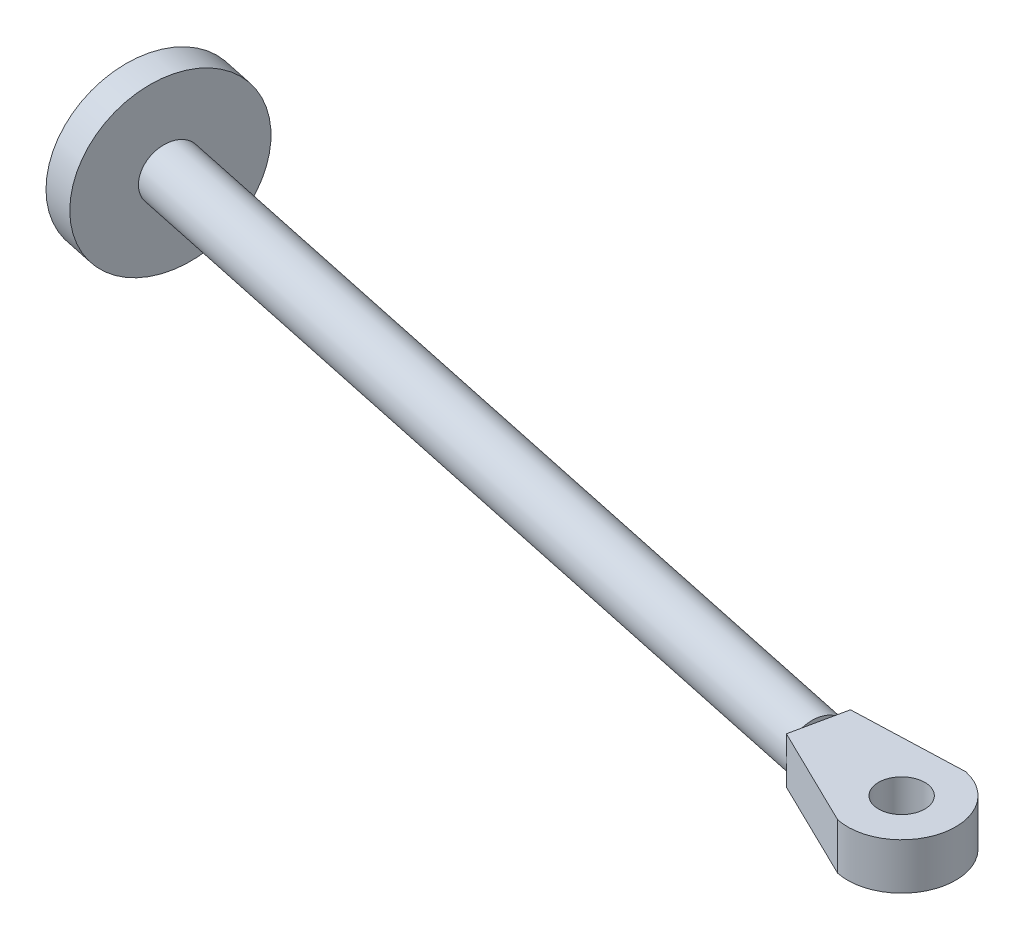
ISO-10303-21;
HEADER;
FILE_DESCRIPTION(('STEP AP214'),'2;1');
FILE_NAME('part.step','',(''),(''),'','','');
FILE_SCHEMA(('AUTOMOTIVE_DESIGN { 1 0 10303 214 1 1 1 1 }'));
ENDSEC;
DATA;
#1=APPLICATION_CONTEXT('core data for automotive mechanical design processes');
#2=APPLICATION_PROTOCOL_DEFINITION('international standard','automotive_design',2000,#1);
#3=PRODUCT_CONTEXT('',#1,'mechanical');
#4=PRODUCT('Part','Part','',(#3));
#5=PRODUCT_RELATED_PRODUCT_CATEGORY('part','',(#4));
#6=PRODUCT_DEFINITION_FORMATION('','',#4);
#7=PRODUCT_DEFINITION_CONTEXT('part definition',#1,'design');
#8=PRODUCT_DEFINITION('design','',#6,#7);
#9=PRODUCT_DEFINITION_SHAPE('','',#8);
#10=(LENGTH_UNIT() NAMED_UNIT(*) SI_UNIT(.MILLI.,.METRE.));
#11=(NAMED_UNIT(*) PLANE_ANGLE_UNIT() SI_UNIT($,.RADIAN.));
#12=(NAMED_UNIT(*) SI_UNIT($,.STERADIAN.) SOLID_ANGLE_UNIT());
#13=UNCERTAINTY_MEASURE_WITH_UNIT(LENGTH_MEASURE(1.E-05),#10,'distance_accuracy_value','');
#14=(GEOMETRIC_REPRESENTATION_CONTEXT(3) GLOBAL_UNCERTAINTY_ASSIGNED_CONTEXT((#13)) GLOBAL_UNIT_ASSIGNED_CONTEXT((#10,
#11,#12)) REPRESENTATION_CONTEXT('',''));
#15=CARTESIAN_POINT('',(0.,0.,0.));
#16=DIRECTION('',(0.,0.,1.));
#17=DIRECTION('',(1.,0.,0.));
#18=AXIS2_PLACEMENT_3D('',#15,#16,#17);
#19=CARTESIAN_POINT('',(-284.802016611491,47.,579.732584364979));
#20=DIRECTION('',(0.978229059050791,0.,0.207528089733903));
#21=DIRECTION('',(0.,-1.,0.));
#22=AXIS2_PLACEMENT_3D('',#19,#20,#21);
#23=CYLINDRICAL_SURFACE('',#22,17.5);
#24=CARTESIAN_POINT('',(253.223965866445,47.,693.873033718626));
#25=DIRECTION('',(-0.978229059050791,0.,-0.207528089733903));
#26=DIRECTION('',(0.,1.,0.));
#27=AXIS2_PLACEMENT_3D('',#24,#25,#26);
#28=CIRCLE('',#27,17.5);
#29=CARTESIAN_POINT('',(255.094598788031,62.,685.055396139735));
#30=VERTEX_POINT('',#29);
#31=CARTESIAN_POINT('',(256.855707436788,47.,676.754025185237));
#32=VERTEX_POINT('',#31);
#33=EDGE_CURVE('E64',#30,#32,#28,.T.);
#34=ORIENTED_EDGE('',*,*,#33,.T.);
#35=CARTESIAN_POINT('',(255.094598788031,31.9999999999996,685.055396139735));
#36=VERTEX_POINT('',#35);
#37=EDGE_CURVE('E135',#32,#36,#28,.T.);
#38=ORIENTED_EDGE('',*,*,#37,.T.);
#39=CARTESIAN_POINT('',(251.353332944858,31.9999999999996,702.690671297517));
#40=VERTEX_POINT('',#39);
#41=EDGE_CURVE('E325',#36,#40,#28,.T.);
#42=ORIENTED_EDGE('',*,*,#41,.T.);
#43=CARTESIAN_POINT('',(249.592224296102,47.,710.992042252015));
#44=VERTEX_POINT('',#43);
#45=EDGE_CURVE('E171',#40,#44,#28,.T.);
#46=ORIENTED_EDGE('',*,*,#45,.T.);
#47=CARTESIAN_POINT('',(251.353332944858,62.,702.690671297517));
#48=VERTEX_POINT('',#47);
#49=EDGE_CURVE('E330',#44,#48,#28,.T.);
#50=ORIENTED_EDGE('',*,*,#49,.T.);
#51=EDGE_CURVE('E137',#48,#30,#28,.T.);
#52=ORIENTED_EDGE('',*,*,#51,.T.);
#53=EDGE_LOOP('',(#34,#38,#42,#46,#50,#52));
#54=FACE_BOUND('',#53,.T.);
#55=CARTESIAN_POINT('',(-279.910871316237,47.,580.770224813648));
#56=DIRECTION('',(-0.978229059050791,0.,-0.207528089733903));
#57=DIRECTION('',(-0.207528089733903,0.,0.978229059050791));
#58=AXIS2_PLACEMENT_3D('',#55,#56,#57);
#59=CIRCLE('',#58,17.5);
#60=CARTESIAN_POINT('',(-283.54261288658,47.,597.889233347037));
#61=VERTEX_POINT('',#60);
#62=EDGE_CURVE('E155',#61,#61,#59,.T.);
#63=ORIENTED_EDGE('',*,*,#62,.F.);
#64=EDGE_LOOP('',(#63));
#65=FACE_BOUND('',#64,.T.);
#66=ADVANCED_FACE('F39',(#54,#65),#23,.T.);
#67=CARTESIAN_POINT('',(256.855707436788,62.,676.754025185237));
#68=DIRECTION('',(0.978229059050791,0.,0.207528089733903));
#69=DIRECTION('',(0.,-1.,0.));
#70=AXIS2_PLACEMENT_3D('',#67,#68,#69);
#71=PLANE('',#70);
#72=ORIENTED_EDGE('',*,*,#33,.F.);
#73=DIRECTION('',(-0.207528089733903,0.,0.978229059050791));
#74=VECTOR('',#73,1.);
#75=CARTESIAN_POINT('',(256.855707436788,62.,676.754025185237));
#76=LINE('',#75,#74);
#77=CARTESIAN_POINT('',(256.855707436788,62.,676.754025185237));
#78=VERTEX_POINT('',#77);
#79=EDGE_CURVE('E138',#78,#30,#76,.T.);
#80=ORIENTED_EDGE('',*,*,#79,.F.);
#81=DIRECTION('',(0.,-1.,0.));
#82=VECTOR('',#81,1.);
#83=CARTESIAN_POINT('',(256.855707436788,62.,676.754025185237));
#84=LINE('',#83,#82);
#85=EDGE_CURVE('E141',#78,#32,#84,.T.);
#86=ORIENTED_EDGE('',*,*,#85,.T.);
#87=EDGE_LOOP('',(#72,#80,#86));
#88=FACE_BOUND('',#87,.T.);
#89=ADVANCED_FACE('F179',(#88),#71,.F.);
#90=ORIENTED_EDGE('',*,*,#37,.F.);
#91=CARTESIAN_POINT('',(256.855707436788,31.9999999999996,676.754025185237));
#92=VERTEX_POINT('',#91);
#93=EDGE_CURVE('E144',#32,#92,#84,.T.);
#94=ORIENTED_EDGE('',*,*,#93,.T.);
#95=DIRECTION('',(-0.207528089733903,0.,0.978229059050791));
#96=VECTOR('',#95,1.);
#97=CARTESIAN_POINT('',(256.855707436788,31.9999999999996,676.754025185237));
#98=LINE('',#97,#96);
#99=EDGE_CURVE('E145',#92,#36,#98,.T.);
#100=ORIENTED_EDGE('',*,*,#99,.T.);
#101=EDGE_LOOP('',(#90,#94,#100));
#102=FACE_BOUND('',#101,.T.);
#103=ADVANCED_FACE('F181',(#102),#71,.F.);
#104=ORIENTED_EDGE('',*,*,#45,.F.);
#105=CARTESIAN_POINT('',(249.592224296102,31.9999999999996,710.992042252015));
#106=VERTEX_POINT('',#105);
#107=EDGE_CURVE('E148',#40,#106,#98,.T.);
#108=ORIENTED_EDGE('',*,*,#107,.T.);
#109=DIRECTION('',(0.,-1.,0.));
#110=VECTOR('',#109,1.);
#111=CARTESIAN_POINT('',(249.592224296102,62.,710.992042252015));
#112=LINE('',#111,#110);
#113=EDGE_CURVE('E56',#44,#106,#112,.T.);
#114=ORIENTED_EDGE('',*,*,#113,.F.);
#115=EDGE_LOOP('',(#104,#108,#114));
#116=FACE_BOUND('',#115,.T.);
#117=ADVANCED_FACE('F169',(#116),#71,.F.);
#118=ORIENTED_EDGE('',*,*,#49,.F.);
#119=CARTESIAN_POINT('',(249.592224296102,62.,710.992042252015));
#120=VERTEX_POINT('',#119);
#121=EDGE_CURVE('E151',#120,#44,#112,.T.);
#122=ORIENTED_EDGE('',*,*,#121,.F.);
#123=EDGE_CURVE('E125',#48,#120,#76,.T.);
#124=ORIENTED_EDGE('',*,*,#123,.F.);
#125=EDGE_LOOP('',(#118,#122,#124));
#126=FACE_BOUND('',#125,.T.);
#127=ADVANCED_FACE('F183',(#126),#71,.F.);
#128=CARTESIAN_POINT('',(321.7,62.,708.4));
#129=DIRECTION('',(0.,1.,0.));
#130=DIRECTION('',(0.978229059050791,0.,0.207528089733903));
#131=AXIS2_PLACEMENT_3D('',#128,#129,#130);
#132=PLANE('',#131);
#133=DIRECTION('',(0.999354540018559,0.,-0.0359235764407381));
#134=VECTOR('',#133,1.);
#135=CARTESIAN_POINT('',(256.855707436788,62.,676.754025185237));
#136=LINE('',#135,#134);
#137=CARTESIAN_POINT('',(328.963483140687,62.,674.161982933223));
#138=VERTEX_POINT('',#137);
#139=EDGE_CURVE('E110',#78,#138,#136,.T.);
#140=ORIENTED_EDGE('',*,*,#139,.F.);
#141=ORIENTED_EDGE('',*,*,#79,.T.);
#142=EDGE_CURVE('E142',#30,#48,#76,.T.);
#143=ORIENTED_EDGE('',*,*,#142,.T.);
#144=ORIENTED_EDGE('',*,*,#123,.T.);
#145=DIRECTION('',(-0.898688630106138,0.,-0.438587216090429));
#146=VECTOR('',#145,1.);
#147=CARTESIAN_POINT('',(249.592224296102,62.,710.992042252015));
#148=LINE('',#147,#146);
#149=CARTESIAN_POINT('',(314.436516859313,62.,742.638017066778));
#150=VERTEX_POINT('',#149);
#151=EDGE_CURVE('E104',#150,#120,#148,.T.);
#152=ORIENTED_EDGE('',*,*,#151,.F.);
#153=CARTESIAN_POINT('',(321.7,62.,708.4));
#154=DIRECTION('',(0.,-1.,0.));
#155=DIRECTION('',(0.,0.,1.));
#156=AXIS2_PLACEMENT_3D('',#153,#154,#155);
#157=CIRCLE('',#156,35.);
#158=EDGE_CURVE('E113',#138,#150,#157,.T.);
#159=ORIENTED_EDGE('',*,*,#158,.F.);
#160=EDGE_LOOP('',(#140,#141,#143,#144,#152,#159));
#161=FACE_BOUND('',#160,.T.);
#162=CARTESIAN_POINT('',(321.7,62.,708.4));
#163=DIRECTION('',(0.,1.,0.));
#164=DIRECTION('',(0.,0.,1.));
#165=AXIS2_PLACEMENT_3D('',#162,#163,#164);
#166=CIRCLE('',#165,15.);
#167=CARTESIAN_POINT('',(321.7,62.,723.4));
#168=VERTEX_POINT('',#167);
#169=EDGE_CURVE('E129',#168,#168,#166,.T.);
#170=ORIENTED_EDGE('',*,*,#169,.F.);
#171=EDGE_LOOP('',(#170));
#172=FACE_BOUND('',#171,.T.);
#173=ADVANCED_FACE('F121',(#161,#172),#132,.T.);
#174=CARTESIAN_POINT('',(321.7,31.9999999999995,708.4));
#175=DIRECTION('',(0.,1.,0.));
#176=DIRECTION('',(0.978229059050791,0.,0.207528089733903));
#177=AXIS2_PLACEMENT_3D('',#174,#175,#176);
#178=PLANE('',#177);
#179=CARTESIAN_POINT('',(321.7,31.9999999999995,708.4));
#180=DIRECTION('',(0.,1.,0.));
#181=DIRECTION('',(0.,0.,1.));
#182=AXIS2_PLACEMENT_3D('',#179,#180,#181);
#183=CIRCLE('',#182,15.);
#184=CARTESIAN_POINT('',(321.7,31.9999999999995,723.4));
#185=VERTEX_POINT('',#184);
#186=EDGE_CURVE('E133',#185,#185,#183,.T.);
#187=ORIENTED_EDGE('',*,*,#186,.T.);
#188=EDGE_LOOP('',(#187));
#189=FACE_BOUND('',#188,.T.);
#190=ORIENTED_EDGE('',*,*,#99,.F.);
#191=DIRECTION('',(0.99935454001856,0.,-0.0359235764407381));
#192=VECTOR('',#191,1.);
#193=CARTESIAN_POINT('',(320.480215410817,31.9999999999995,674.466929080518));
#194=LINE('',#193,#192);
#195=CARTESIAN_POINT('',(328.963483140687,31.9999999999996,674.161982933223));
#196=VERTEX_POINT('',#195);
#197=EDGE_CURVE('E13',#92,#196,#194,.T.);
#198=ORIENTED_EDGE('',*,*,#197,.T.);
#199=CARTESIAN_POINT('',(321.7,31.9999999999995,708.4));
#200=DIRECTION('',(0.,1.,0.));
#201=DIRECTION('',(0.,0.,1.));
#202=AXIS2_PLACEMENT_3D('',#199,#200,#201);
#203=CIRCLE('',#202,35.);
#204=CARTESIAN_POINT('',(314.436516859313,31.9999999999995,742.638017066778));
#205=VERTEX_POINT('',#204);
#206=EDGE_CURVE('E48',#196,#205,#203,.F.);
#207=ORIENTED_EDGE('',*,*,#206,.T.);
#208=DIRECTION('',(-0.898688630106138,0.,-0.438587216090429));
#209=VECTOR('',#208,1.);
#210=CARTESIAN_POINT('',(306.807776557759,31.9999999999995,738.914961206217));
#211=LINE('',#210,#209);
#212=EDGE_CURVE('E106',#205,#106,#211,.T.);
#213=ORIENTED_EDGE('',*,*,#212,.T.);
#214=ORIENTED_EDGE('',*,*,#107,.F.);
#215=EDGE_CURVE('E149',#36,#40,#98,.T.);
#216=ORIENTED_EDGE('',*,*,#215,.F.);
#217=EDGE_LOOP('',(#190,#198,#207,#213,#214,#216));
#218=FACE_BOUND('',#217,.T.);
#219=ADVANCED_FACE('F174',(#189,#218),#178,.F.);
#220=CARTESIAN_POINT('',(253.223965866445,47.,693.873033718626));
#221=DIRECTION('',(-0.978229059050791,0.,-0.207528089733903));
#222=DIRECTION('',(0.,1.,0.));
#223=AXIS2_PLACEMENT_3D('',#220,#221,#222);
#224=PLANE('',#223);
#225=ORIENTED_EDGE('',*,*,#41,.F.);
#226=ORIENTED_EDGE('',*,*,#215,.T.);
#227=EDGE_LOOP('',(#225,#226));
#228=FACE_BOUND('',#227,.T.);
#229=ADVANCED_FACE('F205',(#228),#224,.F.);
#230=ORIENTED_EDGE('',*,*,#142,.F.);
#231=ORIENTED_EDGE('',*,*,#51,.F.);
#232=EDGE_LOOP('',(#230,#231));
#233=FACE_BOUND('',#232,.T.);
#234=ADVANCED_FACE('F192',(#233),#224,.F.);
#235=CARTESIAN_POINT('',(-279.910871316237,47.,580.770224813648));
#236=DIRECTION('',(-0.978229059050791,0.,-0.207528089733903));
#237=DIRECTION('',(-0.207528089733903,0.,0.978229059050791));
#238=AXIS2_PLACEMENT_3D('',#235,#236,#237);
#239=PLANE('',#238);
#240=CARTESIAN_POINT('',(-279.910871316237,47.,580.770224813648));
#241=DIRECTION('',(-0.978229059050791,0.,-0.207528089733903));
#242=DIRECTION('',(-0.207528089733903,0.,0.978229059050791));
#243=AXIS2_PLACEMENT_3D('',#240,#241,#242);
#244=CIRCLE('',#243,55.);
#245=CARTESIAN_POINT('',(-291.324916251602,47.,634.572823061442));
#246=VERTEX_POINT('',#245);
#247=EDGE_CURVE('E136',#246,#246,#244,.T.);
#248=ORIENTED_EDGE('',*,*,#247,.F.);
#249=EDGE_LOOP('',(#248));
#250=FACE_BOUND('',#249,.T.);
#251=ORIENTED_EDGE('',*,*,#62,.T.);
#252=EDGE_LOOP('',(#251));
#253=FACE_BOUND('',#252,.T.);
#254=ADVANCED_FACE('F184',(#250,#253),#239,.F.);
#255=CARTESIAN_POINT('',(-275.019726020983,47.,581.807865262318));
#256=DIRECTION('',(-0.978229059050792,0.,-0.207528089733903));
#257=DIRECTION('',(-0.207528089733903,0.,0.978229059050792));
#258=AXIS2_PLACEMENT_3D('',#255,#256,#257);
#259=CYLINDRICAL_SURFACE('',#258,55.);
#260=ORIENTED_EDGE('',*,*,#247,.T.);
#261=EDGE_LOOP('',(#260));
#262=FACE_BOUND('',#261,.T.);
#263=CARTESIAN_POINT('',(-299.475452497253,47.,576.619663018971));
#264=DIRECTION('',(-0.978229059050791,0.,-0.207528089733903));
#265=DIRECTION('',(-0.207528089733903,0.,0.978229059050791));
#266=AXIS2_PLACEMENT_3D('',#263,#264,#265);
#267=CIRCLE('',#266,55.);
#268=CARTESIAN_POINT('',(-310.889497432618,47.,630.422261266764));
#269=VERTEX_POINT('',#268);
#270=EDGE_CURVE('E43',#269,#269,#267,.T.);
#271=ORIENTED_EDGE('',*,*,#270,.F.);
#272=EDGE_LOOP('',(#271));
#273=FACE_BOUND('',#272,.T.);
#274=ADVANCED_FACE('F198',(#262,#273),#259,.T.);
#275=CARTESIAN_POINT('',(-299.475452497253,47.,576.619663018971));
#276=DIRECTION('',(-0.978229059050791,0.,-0.207528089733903));
#277=DIRECTION('',(0.,1.,0.));
#278=AXIS2_PLACEMENT_3D('',#275,#276,#277);
#279=PLANE('',#278);
#280=ORIENTED_EDGE('',*,*,#270,.T.);
#281=EDGE_LOOP('',(#280));
#282=FACE_BOUND('',#281,.T.);
#283=ADVANCED_FACE('F41',(#282),#279,.T.);
#284=CARTESIAN_POINT('',(321.7,-8.00000000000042,708.4));
#285=DIRECTION('',(0.,1.,0.));
#286=DIRECTION('',(0.,0.,1.));
#287=AXIS2_PLACEMENT_3D('',#284,#285,#286);
#288=CYLINDRICAL_SURFACE('',#287,15.);
#289=ORIENTED_EDGE('',*,*,#169,.T.);
#290=EDGE_LOOP('',(#289));
#291=FACE_BOUND('',#290,.T.);
#292=ORIENTED_EDGE('',*,*,#186,.F.);
#293=EDGE_LOOP('',(#292));
#294=FACE_BOUND('',#293,.T.);
#295=ADVANCED_FACE('F243',(#291,#294),#288,.F.);
#296=CARTESIAN_POINT('',(321.7,-8.00000000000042,708.4));
#297=DIRECTION('',(0.,1.,0.));
#298=DIRECTION('',(0.,0.,1.));
#299=AXIS2_PLACEMENT_3D('',#296,#297,#298);
#300=CYLINDRICAL_SURFACE('',#299,35.);
#301=DIRECTION('',(0.,1.,0.));
#302=VECTOR('',#301,1.);
#303=CARTESIAN_POINT('',(328.963483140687,-8.0000000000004,674.161982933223));
#304=LINE('',#303,#302);
#305=EDGE_CURVE('E109',#196,#138,#304,.T.);
#306=ORIENTED_EDGE('',*,*,#305,.T.);
#307=ORIENTED_EDGE('',*,*,#158,.T.);
#308=DIRECTION('',(0.,1.,0.));
#309=VECTOR('',#308,1.);
#310=CARTESIAN_POINT('',(314.436516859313,-8.00000000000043,742.638017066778));
#311=LINE('',#310,#309);
#312=EDGE_CURVE('E100',#205,#150,#311,.T.);
#313=ORIENTED_EDGE('',*,*,#312,.F.);
#314=ORIENTED_EDGE('',*,*,#206,.F.);
#315=EDGE_LOOP('',(#306,#307,#313,#314));
#316=FACE_BOUND('',#315,.T.);
#317=ADVANCED_FACE('F114',(#316),#300,.T.);
#318=CARTESIAN_POINT('',(256.855707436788,-8.00000000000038,676.754025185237));
#319=DIRECTION('',(0.0359235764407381,0.,0.999354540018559));
#320=DIRECTION('',(0.999354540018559,0.,-0.0359235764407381));
#321=AXIS2_PLACEMENT_3D('',#318,#319,#320);
#322=PLANE('',#321);
#323=ORIENTED_EDGE('',*,*,#93,.F.);
#324=ORIENTED_EDGE('',*,*,#85,.F.);
#325=ORIENTED_EDGE('',*,*,#139,.T.);
#326=ORIENTED_EDGE('',*,*,#305,.F.);
#327=ORIENTED_EDGE('',*,*,#197,.F.);
#328=EDGE_LOOP('',(#323,#324,#325,#326,#327));
#329=FACE_BOUND('',#328,.T.);
#330=ADVANCED_FACE('F176',(#329),#322,.F.);
#331=CARTESIAN_POINT('',(249.592224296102,-8.00000000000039,710.992042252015));
#332=DIRECTION('',(0.438587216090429,0.,-0.898688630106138));
#333=DIRECTION('',(-0.898688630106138,0.,-0.438587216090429));
#334=AXIS2_PLACEMENT_3D('',#331,#332,#333);
#335=PLANE('',#334);
#336=ORIENTED_EDGE('',*,*,#312,.T.);
#337=ORIENTED_EDGE('',*,*,#151,.T.);
#338=ORIENTED_EDGE('',*,*,#121,.T.);
#339=ORIENTED_EDGE('',*,*,#113,.T.);
#340=ORIENTED_EDGE('',*,*,#212,.F.);
#341=EDGE_LOOP('',(#336,#337,#338,#339,#340));
#342=FACE_BOUND('',#341,.T.);
#343=ADVANCED_FACE('F102',(#342),#335,.F.);
#344=CLOSED_SHELL('',(#66,#89,#103,#117,#127,#173,#219,#229,#234,#254,#274,#283,#295,#317,#330,#343));
#345=MANIFOLD_SOLID_BREP('B2',#344);
#346=ADVANCED_BREP_SHAPE_REPRESENTATION('',(#18,#345),#14);
#347=SHAPE_DEFINITION_REPRESENTATION(#9,#346);
ENDSEC;
END-ISO-10303-21;
